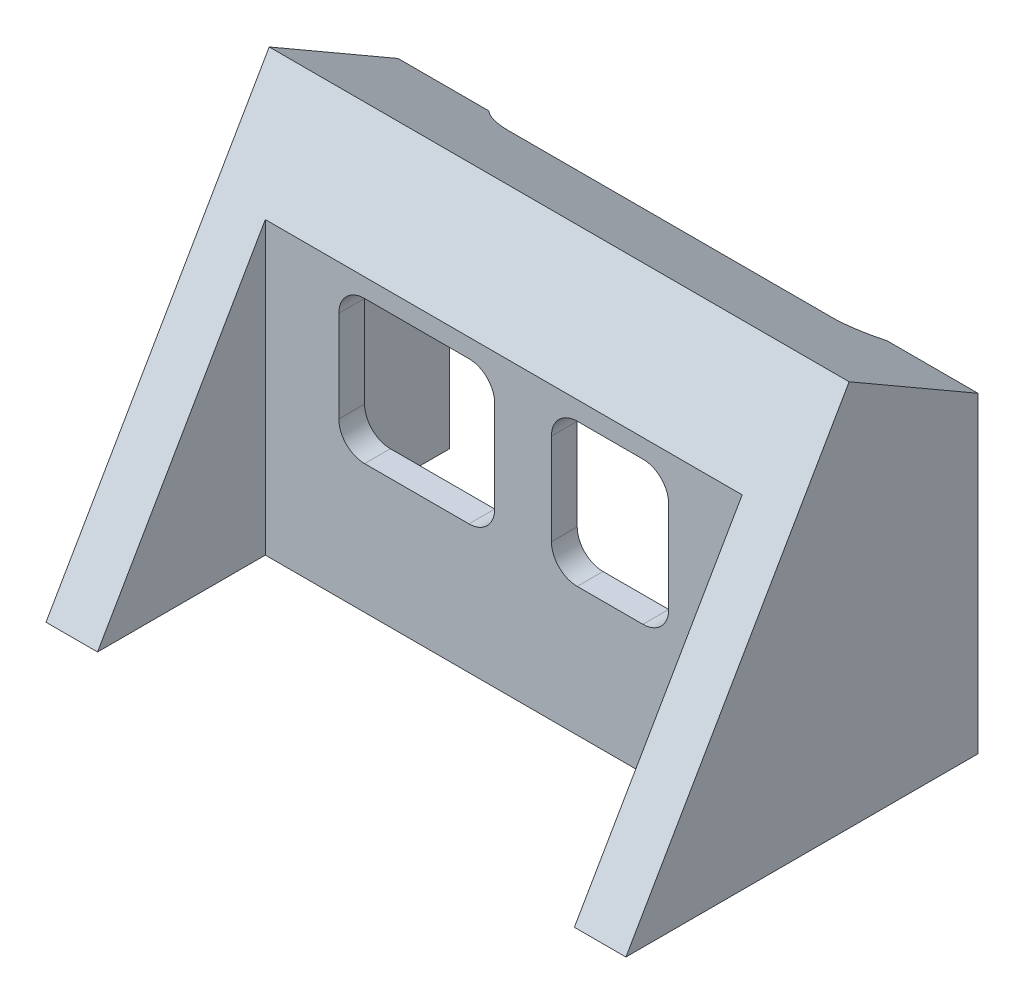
ISO-10303-21;
HEADER;
FILE_DESCRIPTION(('STEP AP214'),'2;1');
FILE_NAME('part.step','',(''),(''),'','','');
FILE_SCHEMA(('AUTOMOTIVE_DESIGN { 1 0 10303 214 1 1 1 1 }'));
ENDSEC;
DATA;
#1=APPLICATION_CONTEXT('core data for automotive mechanical design processes');
#2=APPLICATION_PROTOCOL_DEFINITION('international standard','automotive_design',2000,#1);
#3=PRODUCT_CONTEXT('',#1,'mechanical');
#4=PRODUCT('Part','Part','',(#3));
#5=PRODUCT_RELATED_PRODUCT_CATEGORY('part','',(#4));
#6=PRODUCT_DEFINITION_FORMATION('','',#4);
#7=PRODUCT_DEFINITION_CONTEXT('part definition',#1,'design');
#8=PRODUCT_DEFINITION('design','',#6,#7);
#9=PRODUCT_DEFINITION_SHAPE('','',#8);
#10=(LENGTH_UNIT() NAMED_UNIT(*) SI_UNIT(.MILLI.,.METRE.));
#11=(NAMED_UNIT(*) PLANE_ANGLE_UNIT() SI_UNIT($,.RADIAN.));
#12=(NAMED_UNIT(*) SI_UNIT($,.STERADIAN.) SOLID_ANGLE_UNIT());
#13=UNCERTAINTY_MEASURE_WITH_UNIT(LENGTH_MEASURE(1.E-05),#10,'distance_accuracy_value','');
#14=(GEOMETRIC_REPRESENTATION_CONTEXT(3) GLOBAL_UNCERTAINTY_ASSIGNED_CONTEXT((#13)) GLOBAL_UNIT_ASSIGNED_CONTEXT((#10,
#11,#12)) REPRESENTATION_CONTEXT('',''));
#15=CARTESIAN_POINT('',(0.,0.,0.));
#16=DIRECTION('',(0.,0.,1.));
#17=DIRECTION('',(1.,0.,0.));
#18=AXIS2_PLACEMENT_3D('',#15,#16,#17);
#19=CARTESIAN_POINT('',(22.5,30.,-27.320508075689));
#20=DIRECTION('',(0.,0.,1.));
#21=DIRECTION('',(0.,-1.,0.));
#22=AXIS2_PLACEMENT_3D('',#19,#20,#21);
#23=PLANE('',#22);
#24=DIRECTION('',(0.,1.,0.));
#25=VECTOR('',#24,1.);
#26=CARTESIAN_POINT('',(-22.5,30.,-27.320508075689));
#27=LINE('',#26,#25);
#28=CARTESIAN_POINT('',(-22.5,0.,-27.320508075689));
#29=VERTEX_POINT('',#28);
#30=CARTESIAN_POINT('',(-22.5,24.2264973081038,-27.320508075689));
#31=VERTEX_POINT('',#30);
#32=EDGE_CURVE('E269',#29,#31,#27,.T.);
#33=ORIENTED_EDGE('',*,*,#32,.T.);
#34=DIRECTION('',(1.,0.,0.));
#35=VECTOR('',#34,1.);
#36=CARTESIAN_POINT('',(-22.5,24.2264973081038,-27.320508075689));
#37=LINE('',#36,#35);
#38=CARTESIAN_POINT('',(-15.4468162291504,24.2264973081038,-27.320508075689));
#39=VERTEX_POINT('',#38);
#40=EDGE_CURVE('E58',#31,#39,#37,.T.);
#41=ORIENTED_EDGE('',*,*,#40,.T.);
#42=CARTESIAN_POINT('',(-12.5,19.,-27.320508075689));
#43=DIRECTION('',(0.,0.,1.));
#44=DIRECTION('',(0.,-1.,0.));
#45=AXIS2_PLACEMENT_3D('',#42,#43,#44);
#46=CIRCLE('',#45,6.);
#47=CARTESIAN_POINT('',(-18.5,19.,-27.320508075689));
#48=VERTEX_POINT('',#47);
#49=EDGE_CURVE('E407',#39,#48,#46,.T.);
#50=ORIENTED_EDGE('',*,*,#49,.T.);
#51=DIRECTION('',(0.,-1.,0.));
#52=VECTOR('',#51,1.);
#53=CARTESIAN_POINT('',(-18.5,25.,-27.320508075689));
#54=LINE('',#53,#52);
#55=CARTESIAN_POINT('',(-18.5,0.,-27.320508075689));
#56=VERTEX_POINT('',#55);
#57=EDGE_CURVE('E430',#48,#56,#54,.T.);
#58=ORIENTED_EDGE('',*,*,#57,.T.);
#59=DIRECTION('',(-1.,0.,0.));
#60=VECTOR('',#59,1.);
#61=CARTESIAN_POINT('',(22.5,0.,-27.320508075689));
#62=LINE('',#61,#60);
#63=EDGE_CURVE('E262',#56,#29,#62,.T.);
#64=ORIENTED_EDGE('',*,*,#63,.T.);
#65=EDGE_LOOP('',(#33,#41,#50,#58,#64));
#66=FACE_BOUND('',#65,.T.);
#67=ADVANCED_FACE('F36',(#66),#23,.F.);
#68=CARTESIAN_POINT('',(22.5,0.,-27.320508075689));
#69=DIRECTION('',(0.,1.,0.));
#70=DIRECTION('',(0.,0.,1.));
#71=AXIS2_PLACEMENT_3D('',#68,#69,#70);
#72=PLANE('',#71);
#73=CARTESIAN_POINT('',(-20.5,0.,-7.32050807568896));
#74=DIRECTION('',(0.,-1.,0.));
#75=DIRECTION('',(0.,0.,-1.));
#76=AXIS2_PLACEMENT_3D('',#73,#74,#75);
#77=CIRCLE('',#76,1.24999999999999);
#78=CARTESIAN_POINT('',(-20.5,0.,-8.57050807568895));
#79=VERTEX_POINT('',#78);
#80=EDGE_CURVE('E478',#79,#79,#77,.T.);
#81=ORIENTED_EDGE('',*,*,#80,.F.);
#82=EDGE_LOOP('',(#81));
#83=FACE_BOUND('',#82,.T.);
#84=CARTESIAN_POINT('',(-20.5,0.,-22.320508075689));
#85=DIRECTION('',(0.,-1.,0.));
#86=DIRECTION('',(0.,0.,-1.));
#87=AXIS2_PLACEMENT_3D('',#84,#85,#86);
#88=CIRCLE('',#87,1.24999999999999);
#89=CARTESIAN_POINT('',(-20.5,0.,-23.5705080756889));
#90=VERTEX_POINT('',#89);
#91=EDGE_CURVE('E484',#90,#90,#88,.T.);
#92=ORIENTED_EDGE('',*,*,#91,.F.);
#93=EDGE_LOOP('',(#92));
#94=FACE_BOUND('',#93,.T.);
#95=CARTESIAN_POINT('',(20.5,0.,-7.32050807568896));
#96=DIRECTION('',(0.,-1.,0.));
#97=DIRECTION('',(0.,0.,-1.));
#98=AXIS2_PLACEMENT_3D('',#95,#96,#97);
#99=CIRCLE('',#98,1.24999999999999);
#100=CARTESIAN_POINT('',(20.5,0.,-8.57050807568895));
#101=VERTEX_POINT('',#100);
#102=EDGE_CURVE('E490',#101,#101,#99,.T.);
#103=ORIENTED_EDGE('',*,*,#102,.F.);
#104=EDGE_LOOP('',(#103));
#105=FACE_BOUND('',#104,.T.);
#106=CARTESIAN_POINT('',(20.5,0.,-22.320508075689));
#107=DIRECTION('',(0.,-1.,0.));
#108=DIRECTION('',(0.,0.,-1.));
#109=AXIS2_PLACEMENT_3D('',#106,#107,#108);
#110=CIRCLE('',#109,1.24999999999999);
#111=CARTESIAN_POINT('',(20.5,0.,-23.5705080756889));
#112=VERTEX_POINT('',#111);
#113=EDGE_CURVE('E496',#112,#112,#110,.T.);
#114=ORIENTED_EDGE('',*,*,#113,.F.);
#115=EDGE_LOOP('',(#114));
#116=FACE_BOUND('',#115,.T.);
#117=DIRECTION('',(0.,0.,1.));
#118=VECTOR('',#117,1.);
#119=CARTESIAN_POINT('',(-18.5,0.,-27.320508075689));
#120=LINE('',#119,#118);
#121=CARTESIAN_POINT('',(-18.5,0.,-15.02));
#122=VERTEX_POINT('',#121);
#123=EDGE_CURVE('E436',#56,#122,#120,.T.);
#124=ORIENTED_EDGE('',*,*,#123,.T.);
#125=DIRECTION('',(1.,0.,0.));
#126=VECTOR('',#125,1.);
#127=CARTESIAN_POINT('',(-18.5,0.,-15.02));
#128=LINE('',#127,#126);
#129=CARTESIAN_POINT('',(18.5,0.,-15.02));
#130=VERTEX_POINT('',#129);
#131=EDGE_CURVE('E529',#122,#130,#128,.T.);
#132=ORIENTED_EDGE('',*,*,#131,.T.);
#133=DIRECTION('',(0.,0.,-1.));
#134=VECTOR('',#133,1.);
#135=CARTESIAN_POINT('',(18.5,0.,-15.02));
#136=LINE('',#135,#134);
#137=CARTESIAN_POINT('',(18.5,0.,-27.320508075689));
#138=VERTEX_POINT('',#137);
#139=EDGE_CURVE('E527',#130,#138,#136,.T.);
#140=ORIENTED_EDGE('',*,*,#139,.T.);
#141=CARTESIAN_POINT('',(22.5,0.,-27.320508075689));
#142=VERTEX_POINT('',#141);
#143=EDGE_CURVE('E280',#142,#138,#62,.T.);
#144=ORIENTED_EDGE('',*,*,#143,.F.);
#145=DIRECTION('',(0.,0.,-1.));
#146=VECTOR('',#145,1.);
#147=CARTESIAN_POINT('',(22.5,0.,-27.320508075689));
#148=LINE('',#147,#146);
#149=CARTESIAN_POINT('',(22.5,0.,0.));
#150=VERTEX_POINT('',#149);
#151=EDGE_CURVE('E268',#150,#142,#148,.T.);
#152=ORIENTED_EDGE('',*,*,#151,.F.);
#153=DIRECTION('',(-1.,0.,0.));
#154=VECTOR('',#153,1.);
#155=CARTESIAN_POINT('',(22.5,0.,0.));
#156=LINE('',#155,#154);
#157=CARTESIAN_POINT('',(18.5,0.,0.));
#158=VERTEX_POINT('',#157);
#159=EDGE_CURVE('E263',#150,#158,#156,.T.);
#160=ORIENTED_EDGE('',*,*,#159,.T.);
#161=DIRECTION('',(0.,0.,-1.));
#162=VECTOR('',#161,1.);
#163=CARTESIAN_POINT('',(18.5,0.,-27.320508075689));
#164=LINE('',#163,#162);
#165=CARTESIAN_POINT('',(18.5,0.,-13.02));
#166=VERTEX_POINT('',#165);
#167=EDGE_CURVE('E450',#158,#166,#164,.T.);
#168=ORIENTED_EDGE('',*,*,#167,.T.);
#169=DIRECTION('',(-1.,0.,0.));
#170=VECTOR('',#169,1.);
#171=CARTESIAN_POINT('',(22.5,0.,-13.02));
#172=LINE('',#171,#170);
#173=CARTESIAN_POINT('',(-18.5,0.,-13.02));
#174=VERTEX_POINT('',#173);
#175=EDGE_CURVE('E453',#166,#174,#172,.T.);
#176=ORIENTED_EDGE('',*,*,#175,.T.);
#177=DIRECTION('',(0.,0.,1.));
#178=VECTOR('',#177,1.);
#179=CARTESIAN_POINT('',(-18.5,0.,-27.3205080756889));
#180=LINE('',#179,#178);
#181=CARTESIAN_POINT('',(-18.5,0.,0.));
#182=VERTEX_POINT('',#181);
#183=EDGE_CURVE('E456',#174,#182,#180,.T.);
#184=ORIENTED_EDGE('',*,*,#183,.T.);
#185=CARTESIAN_POINT('',(-22.5,0.,0.));
#186=VERTEX_POINT('',#185);
#187=EDGE_CURVE('E278',#182,#186,#156,.T.);
#188=ORIENTED_EDGE('',*,*,#187,.T.);
#189=DIRECTION('',(0.,0.,-1.));
#190=VECTOR('',#189,1.);
#191=CARTESIAN_POINT('',(-22.5,0.,-27.320508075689));
#192=LINE('',#191,#190);
#193=EDGE_CURVE('E267',#186,#29,#192,.T.);
#194=ORIENTED_EDGE('',*,*,#193,.T.);
#195=ORIENTED_EDGE('',*,*,#63,.F.);
#196=EDGE_LOOP('',(#124,#132,#140,#144,#152,#160,#168,#176,#184,#188,#194,#195));
#197=FACE_BOUND('',#196,.T.);
#198=ADVANCED_FACE('F461',(#83,#94,#105,#116,#197),#72,.F.);
#199=DIRECTION('',(0.,-1.,0.));
#200=VECTOR('',#199,1.);
#201=CARTESIAN_POINT('',(18.5,25.,-27.320508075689));
#202=LINE('',#201,#200);
#203=CARTESIAN_POINT('',(18.5,19.,-27.320508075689));
#204=VERTEX_POINT('',#203);
#205=EDGE_CURVE('E413',#204,#138,#202,.T.);
#206=ORIENTED_EDGE('',*,*,#205,.F.);
#207=CARTESIAN_POINT('',(12.5,19.,-27.320508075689));
#208=DIRECTION('',(0.,0.,1.));
#209=DIRECTION('',(0.,-1.,0.));
#210=AXIS2_PLACEMENT_3D('',#207,#208,#209);
#211=CIRCLE('',#210,6.);
#212=CARTESIAN_POINT('',(15.4468162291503,24.2264973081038,-27.320508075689));
#213=VERTEX_POINT('',#212);
#214=EDGE_CURVE('E44',#204,#213,#211,.T.);
#215=ORIENTED_EDGE('',*,*,#214,.T.);
#216=CARTESIAN_POINT('',(22.5,24.2264973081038,-27.320508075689));
#217=VERTEX_POINT('',#216);
#218=EDGE_CURVE('E50',#213,#217,#37,.T.);
#219=ORIENTED_EDGE('',*,*,#218,.T.);
#220=DIRECTION('',(0.,1.,0.));
#221=VECTOR('',#220,1.);
#222=CARTESIAN_POINT('',(22.5,30.,-27.320508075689));
#223=LINE('',#222,#221);
#224=EDGE_CURVE('E272',#142,#217,#223,.T.);
#225=ORIENTED_EDGE('',*,*,#224,.F.);
#226=ORIENTED_EDGE('',*,*,#143,.T.);
#227=EDGE_LOOP('',(#206,#215,#219,#225,#226));
#228=FACE_BOUND('',#227,.T.);
#229=ADVANCED_FACE('F411',(#228),#23,.F.);
#230=CARTESIAN_POINT('',(22.5,0.,0.));
#231=DIRECTION('',(0.,-0.500000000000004,-0.866025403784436));
#232=DIRECTION('',(0.,0.866025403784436,-0.500000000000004));
#233=AXIS2_PLACEMENT_3D('',#230,#231,#232);
#234=PLANE('',#233);
#235=ORIENTED_EDGE('',*,*,#187,.F.);
#236=DIRECTION('',(0.,0.866025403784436,-0.500000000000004));
#237=VECTOR('',#236,1.);
#238=CARTESIAN_POINT('',(-18.5,0.,0.));
#239=LINE('',#238,#237);
#240=CARTESIAN_POINT('',(-18.5,22.5513015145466,-13.02));
#241=VERTEX_POINT('',#240);
#242=EDGE_CURVE('E289',#182,#241,#239,.T.);
#243=ORIENTED_EDGE('',*,*,#242,.T.);
#244=DIRECTION('',(1.,0.,0.));
#245=VECTOR('',#244,1.);
#246=CARTESIAN_POINT('',(22.5,22.5513015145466,-13.02));
#247=LINE('',#246,#245);
#248=CARTESIAN_POINT('',(18.5,22.5513015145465,-13.02));
#249=VERTEX_POINT('',#248);
#250=EDGE_CURVE('E286',#241,#249,#247,.T.);
#251=ORIENTED_EDGE('',*,*,#250,.T.);
#252=DIRECTION('',(0.,-0.866025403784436,0.500000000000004));
#253=VECTOR('',#252,1.);
#254=CARTESIAN_POINT('',(18.5,0.,0.));
#255=LINE('',#254,#253);
#256=EDGE_CURVE('E283',#249,#158,#255,.T.);
#257=ORIENTED_EDGE('',*,*,#256,.T.);
#258=ORIENTED_EDGE('',*,*,#159,.F.);
#259=DIRECTION('',(0.,-0.866025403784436,0.500000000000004));
#260=VECTOR('',#259,1.);
#261=CARTESIAN_POINT('',(22.5,0.,0.));
#262=LINE('',#261,#260);
#263=CARTESIAN_POINT('',(22.5,30.,-17.3205080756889));
#264=VERTEX_POINT('',#263);
#265=EDGE_CURVE('E261',#264,#150,#262,.T.);
#266=ORIENTED_EDGE('',*,*,#265,.F.);
#267=DIRECTION('',(-1.,0.,0.));
#268=VECTOR('',#267,1.);
#269=CARTESIAN_POINT('',(22.5,30.,-17.3205080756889));
#270=LINE('',#269,#268);
#271=CARTESIAN_POINT('',(-22.5,30.,-17.3205080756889));
#272=VERTEX_POINT('',#271);
#273=EDGE_CURVE('E246',#264,#272,#270,.T.);
#274=ORIENTED_EDGE('',*,*,#273,.T.);
#275=DIRECTION('',(0.,-0.866025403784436,0.500000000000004));
#276=VECTOR('',#275,1.);
#277=CARTESIAN_POINT('',(-22.5,0.,0.));
#278=LINE('',#277,#276);
#279=EDGE_CURVE('E258',#272,#186,#278,.T.);
#280=ORIENTED_EDGE('',*,*,#279,.T.);
#281=EDGE_LOOP('',(#235,#243,#251,#257,#258,#266,#274,#280));
#282=FACE_BOUND('',#281,.T.);
#283=ADVANCED_FACE('F257',(#282),#234,.F.);
#284=CARTESIAN_POINT('',(22.5,0.,0.));
#285=DIRECTION('',(1.,0.,0.));
#286=DIRECTION('',(0.,0.,-1.));
#287=AXIS2_PLACEMENT_3D('',#284,#285,#286);
#288=PLANE('',#287);
#289=DIRECTION('',(0.,-0.499999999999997,-0.866025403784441));
#290=VECTOR('',#289,1.);
#291=CARTESIAN_POINT('',(22.5,30.,-17.3205080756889));
#292=LINE('',#291,#290);
#293=EDGE_CURVE('E251',#264,#217,#292,.T.);
#294=ORIENTED_EDGE('',*,*,#293,.F.);
#295=ORIENTED_EDGE('',*,*,#265,.T.);
#296=ORIENTED_EDGE('',*,*,#151,.T.);
#297=ORIENTED_EDGE('',*,*,#224,.T.);
#298=EDGE_LOOP('',(#294,#295,#296,#297));
#299=FACE_BOUND('',#298,.T.);
#300=ADVANCED_FACE('F474',(#299),#288,.T.);
#301=CARTESIAN_POINT('',(-22.5,0.,0.));
#302=DIRECTION('',(1.,0.,0.));
#303=DIRECTION('',(0.,0.,-1.));
#304=AXIS2_PLACEMENT_3D('',#301,#302,#303);
#305=PLANE('',#304);
#306=ORIENTED_EDGE('',*,*,#279,.F.);
#307=DIRECTION('',(0.,-0.499999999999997,-0.866025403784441));
#308=VECTOR('',#307,1.);
#309=CARTESIAN_POINT('',(-22.5,30.,-17.3205080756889));
#310=LINE('',#309,#308);
#311=EDGE_CURVE('E242',#272,#31,#310,.T.);
#312=ORIENTED_EDGE('',*,*,#311,.T.);
#313=ORIENTED_EDGE('',*,*,#32,.F.);
#314=ORIENTED_EDGE('',*,*,#193,.F.);
#315=EDGE_LOOP('',(#306,#312,#313,#314));
#316=FACE_BOUND('',#315,.T.);
#317=ADVANCED_FACE('F265',(#316),#305,.F.);
#318=CARTESIAN_POINT('',(-18.5,75.7402031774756,0.));
#319=DIRECTION('',(-1.,0.,0.));
#320=DIRECTION('',(0.,0.,1.));
#321=AXIS2_PLACEMENT_3D('',#318,#319,#320);
#322=PLANE('',#321);
#323=ORIENTED_EDGE('',*,*,#183,.F.);
#324=DIRECTION('',(0.,-1.,0.));
#325=VECTOR('',#324,1.);
#326=CARTESIAN_POINT('',(-18.5,75.7402031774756,-13.02));
#327=LINE('',#326,#325);
#328=EDGE_CURVE('E442',#241,#174,#327,.T.);
#329=ORIENTED_EDGE('',*,*,#328,.F.);
#330=ORIENTED_EDGE('',*,*,#242,.F.);
#331=EDGE_LOOP('',(#323,#329,#330));
#332=FACE_BOUND('',#331,.T.);
#333=ADVANCED_FACE('F464',(#332),#322,.F.);
#334=CARTESIAN_POINT('',(-18.5,75.7402031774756,-13.02));
#335=DIRECTION('',(0.,0.,-1.));
#336=DIRECTION('',(-1.,0.,0.));
#337=AXIS2_PLACEMENT_3D('',#334,#335,#336);
#338=PLANE('',#337);
#339=DIRECTION('',(1.,0.,0.));
#340=VECTOR('',#339,1.);
#341=CARTESIAN_POINT('',(3.7,10.,-13.02));
#342=LINE('',#341,#340);
#343=CARTESIAN_POINT('',(5.7,10.,-13.02));
#344=VERTEX_POINT('',#343);
#345=CARTESIAN_POINT('',(10.8,10.,-13.02));
#346=VERTEX_POINT('',#345);
#347=EDGE_CURVE('E505',#344,#346,#342,.T.);
#348=ORIENTED_EDGE('',*,*,#347,.F.);
#349=CARTESIAN_POINT('',(5.7,12.,-13.02));
#350=DIRECTION('',(0.,0.,-1.));
#351=DIRECTION('',(-1.,0.,0.));
#352=AXIS2_PLACEMENT_3D('',#349,#350,#351);
#353=CIRCLE('',#352,2.);
#354=CARTESIAN_POINT('',(3.7,12.,-13.02));
#355=VERTEX_POINT('',#354);
#356=EDGE_CURVE('E367',#344,#355,#353,.T.);
#357=ORIENTED_EDGE('',*,*,#356,.T.);
#358=DIRECTION('',(0.,-1.,0.));
#359=VECTOR('',#358,1.);
#360=CARTESIAN_POINT('',(3.7,10.,-13.02));
#361=LINE('',#360,#359);
#362=CARTESIAN_POINT('',(3.7,19.1,-13.02));
#363=VERTEX_POINT('',#362);
#364=EDGE_CURVE('E502',#363,#355,#361,.T.);
#365=ORIENTED_EDGE('',*,*,#364,.F.);
#366=CARTESIAN_POINT('',(5.7,19.1,-13.02));
#367=DIRECTION('',(0.,0.,-1.));
#368=DIRECTION('',(-1.,0.,0.));
#369=AXIS2_PLACEMENT_3D('',#366,#367,#368);
#370=CIRCLE('',#369,2.);
#371=CARTESIAN_POINT('',(5.7,21.1,-13.02));
#372=VERTEX_POINT('',#371);
#373=EDGE_CURVE('E359',#363,#372,#370,.T.);
#374=ORIENTED_EDGE('',*,*,#373,.T.);
#375=DIRECTION('',(-1.,0.,0.));
#376=VECTOR('',#375,1.);
#377=CARTESIAN_POINT('',(3.7,21.1,-13.02));
#378=LINE('',#377,#376);
#379=CARTESIAN_POINT('',(10.8,21.1,-13.02));
#380=VERTEX_POINT('',#379);
#381=EDGE_CURVE('E511',#380,#372,#378,.T.);
#382=ORIENTED_EDGE('',*,*,#381,.F.);
#383=CARTESIAN_POINT('',(10.8,19.1,-13.02));
#384=DIRECTION('',(0.,0.,-1.));
#385=DIRECTION('',(-1.,0.,0.));
#386=AXIS2_PLACEMENT_3D('',#383,#384,#385);
#387=CIRCLE('',#386,2.);
#388=CARTESIAN_POINT('',(12.8,19.1,-13.02));
#389=VERTEX_POINT('',#388);
#390=EDGE_CURVE('E371',#380,#389,#387,.T.);
#391=ORIENTED_EDGE('',*,*,#390,.T.);
#392=DIRECTION('',(0.,1.,0.));
#393=VECTOR('',#392,1.);
#394=CARTESIAN_POINT('',(12.8,10.,-13.02));
#395=LINE('',#394,#393);
#396=CARTESIAN_POINT('',(12.8,12.,-13.02));
#397=VERTEX_POINT('',#396);
#398=EDGE_CURVE('E508',#397,#389,#395,.T.);
#399=ORIENTED_EDGE('',*,*,#398,.F.);
#400=CARTESIAN_POINT('',(10.8,12.,-13.02));
#401=DIRECTION('',(0.,0.,-1.));
#402=DIRECTION('',(-1.,0.,0.));
#403=AXIS2_PLACEMENT_3D('',#400,#401,#402);
#404=CIRCLE('',#403,2.);
#405=EDGE_CURVE('E363',#397,#346,#404,.T.);
#406=ORIENTED_EDGE('',*,*,#405,.T.);
#407=EDGE_LOOP('',(#348,#357,#365,#374,#382,#391,#399,#406));
#408=FACE_BOUND('',#407,.T.);
#409=DIRECTION('',(1.,0.,0.));
#410=VECTOR('',#409,1.);
#411=CARTESIAN_POINT('',(-12.8,10.,-13.02));
#412=LINE('',#411,#410);
#413=CARTESIAN_POINT('',(-10.8,10.,-13.02));
#414=VERTEX_POINT('',#413);
#415=CARTESIAN_POINT('',(-2.7,10.,-13.02));
#416=VERTEX_POINT('',#415);
#417=EDGE_CURVE('E517',#414,#416,#412,.T.);
#418=ORIENTED_EDGE('',*,*,#417,.F.);
#419=CARTESIAN_POINT('',(-10.8,12.,-13.02));
#420=DIRECTION('',(0.,0.,-1.));
#421=DIRECTION('',(-1.,0.,0.));
#422=AXIS2_PLACEMENT_3D('',#419,#420,#421);
#423=CIRCLE('',#422,2.);
#424=CARTESIAN_POINT('',(-12.8,12.,-13.02));
#425=VERTEX_POINT('',#424);
#426=EDGE_CURVE('E383',#414,#425,#423,.T.);
#427=ORIENTED_EDGE('',*,*,#426,.T.);
#428=DIRECTION('',(0.,-1.,0.));
#429=VECTOR('',#428,1.);
#430=CARTESIAN_POINT('',(-12.8,10.,-13.02));
#431=LINE('',#430,#429);
#432=CARTESIAN_POINT('',(-12.8,19.1,-13.02));
#433=VERTEX_POINT('',#432);
#434=EDGE_CURVE('E514',#433,#425,#431,.T.);
#435=ORIENTED_EDGE('',*,*,#434,.F.);
#436=CARTESIAN_POINT('',(-10.8,19.1,-13.02));
#437=DIRECTION('',(0.,0.,-1.));
#438=DIRECTION('',(-1.,0.,0.));
#439=AXIS2_PLACEMENT_3D('',#436,#437,#438);
#440=CIRCLE('',#439,2.);
#441=CARTESIAN_POINT('',(-10.8,21.1,-13.02));
#442=VERTEX_POINT('',#441);
#443=EDGE_CURVE('E387',#433,#442,#440,.T.);
#444=ORIENTED_EDGE('',*,*,#443,.T.);
#445=DIRECTION('',(-1.,0.,0.));
#446=VECTOR('',#445,1.);
#447=CARTESIAN_POINT('',(-12.8,21.1,-13.02));
#448=LINE('',#447,#446);
#449=CARTESIAN_POINT('',(-2.7,21.1,-13.02));
#450=VERTEX_POINT('',#449);
#451=EDGE_CURVE('E523',#450,#442,#448,.T.);
#452=ORIENTED_EDGE('',*,*,#451,.F.);
#453=CARTESIAN_POINT('',(-2.7,19.1,-13.02));
#454=DIRECTION('',(0.,0.,-1.));
#455=DIRECTION('',(-1.,0.,0.));
#456=AXIS2_PLACEMENT_3D('',#453,#454,#455);
#457=CIRCLE('',#456,2.);
#458=CARTESIAN_POINT('',(-0.699999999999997,19.1,-13.02));
#459=VERTEX_POINT('',#458);
#460=EDGE_CURVE('E375',#450,#459,#457,.T.);
#461=ORIENTED_EDGE('',*,*,#460,.T.);
#462=DIRECTION('',(0.,1.,0.));
#463=VECTOR('',#462,1.);
#464=CARTESIAN_POINT('',(-0.699999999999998,10.,-13.02));
#465=LINE('',#464,#463);
#466=CARTESIAN_POINT('',(-0.699999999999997,12.,-13.02));
#467=VERTEX_POINT('',#466);
#468=EDGE_CURVE('E520',#467,#459,#465,.T.);
#469=ORIENTED_EDGE('',*,*,#468,.F.);
#470=CARTESIAN_POINT('',(-2.7,12.,-13.02));
#471=DIRECTION('',(0.,0.,-1.));
#472=DIRECTION('',(-1.,0.,0.));
#473=AXIS2_PLACEMENT_3D('',#470,#471,#472);
#474=CIRCLE('',#473,2.);
#475=EDGE_CURVE('E379',#467,#416,#474,.T.);
#476=ORIENTED_EDGE('',*,*,#475,.T.);
#477=EDGE_LOOP('',(#418,#427,#435,#444,#452,#461,#469,#476));
#478=FACE_BOUND('',#477,.T.);
#479=ORIENTED_EDGE('',*,*,#175,.F.);
#480=DIRECTION('',(0.,-1.,0.));
#481=VECTOR('',#480,1.);
#482=CARTESIAN_POINT('',(18.5,75.7402031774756,-13.02));
#483=LINE('',#482,#481);
#484=EDGE_CURVE('E438',#249,#166,#483,.T.);
#485=ORIENTED_EDGE('',*,*,#484,.F.);
#486=ORIENTED_EDGE('',*,*,#250,.F.);
#487=ORIENTED_EDGE('',*,*,#328,.T.);
#488=EDGE_LOOP('',(#479,#485,#486,#487));
#489=FACE_BOUND('',#488,.T.);
#490=ADVANCED_FACE('F466',(#408,#478,#489),#338,.F.);
#491=CARTESIAN_POINT('',(18.5,75.7402031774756,-13.02));
#492=DIRECTION('',(1.,0.,0.));
#493=DIRECTION('',(0.,0.,-1.));
#494=AXIS2_PLACEMENT_3D('',#491,#492,#493);
#495=PLANE('',#494);
#496=ORIENTED_EDGE('',*,*,#167,.F.);
#497=ORIENTED_EDGE('',*,*,#256,.F.);
#498=ORIENTED_EDGE('',*,*,#484,.T.);
#499=EDGE_LOOP('',(#496,#497,#498));
#500=FACE_BOUND('',#499,.T.);
#501=ADVANCED_FACE('F470',(#500),#495,.F.);
#502=CARTESIAN_POINT('',(-18.5,25.,-27.320508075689));
#503=DIRECTION('',(1.,0.,0.));
#504=DIRECTION('',(0.,0.,-1.));
#505=AXIS2_PLACEMENT_3D('',#502,#503,#504);
#506=PLANE('',#505);
#507=ORIENTED_EDGE('',*,*,#57,.F.);
#508=DIRECTION('',(0.,0.,1.));
#509=VECTOR('',#508,1.);
#510=CARTESIAN_POINT('',(-18.5,19.,-27.320508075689));
#511=LINE('',#510,#509);
#512=CARTESIAN_POINT('',(-18.5,19.,-15.02));
#513=VERTEX_POINT('',#512);
#514=EDGE_CURVE('E391',#48,#513,#511,.T.);
#515=ORIENTED_EDGE('',*,*,#514,.T.);
#516=DIRECTION('',(0.,-1.,0.));
#517=VECTOR('',#516,1.);
#518=CARTESIAN_POINT('',(-18.5,25.,-15.02));
#519=LINE('',#518,#517);
#520=EDGE_CURVE('E439',#513,#122,#519,.T.);
#521=ORIENTED_EDGE('',*,*,#520,.T.);
#522=ORIENTED_EDGE('',*,*,#123,.F.);
#523=EDGE_LOOP('',(#507,#515,#521,#522));
#524=FACE_BOUND('',#523,.T.);
#525=ADVANCED_FACE('F433',(#524),#506,.T.);
#526=CARTESIAN_POINT('',(-18.5,25.,-15.02));
#527=DIRECTION('',(0.,0.,-1.));
#528=DIRECTION('',(-1.,0.,0.));
#529=AXIS2_PLACEMENT_3D('',#526,#527,#528);
#530=PLANE('',#529);
#531=DIRECTION('',(0.,1.,0.));
#532=VECTOR('',#531,1.);
#533=CARTESIAN_POINT('',(3.7,25.,-15.02));
#534=LINE('',#533,#532);
#535=CARTESIAN_POINT('',(3.7,12.,-15.02));
#536=VERTEX_POINT('',#535);
#537=CARTESIAN_POINT('',(3.7,19.1,-15.02));
#538=VERTEX_POINT('',#537);
#539=EDGE_CURVE('E313',#536,#538,#534,.T.);
#540=ORIENTED_EDGE('',*,*,#539,.F.);
#541=CARTESIAN_POINT('',(5.7,12.,-15.02));
#542=DIRECTION('',(0.,0.,-1.));
#543=DIRECTION('',(-1.,0.,0.));
#544=AXIS2_PLACEMENT_3D('',#541,#542,#543);
#545=CIRCLE('',#544,2.);
#546=CARTESIAN_POINT('',(5.7,10.,-15.02));
#547=VERTEX_POINT('',#546);
#548=EDGE_CURVE('E369',#536,#547,#545,.F.);
#549=ORIENTED_EDGE('',*,*,#548,.T.);
#550=DIRECTION('',(-1.,0.,0.));
#551=VECTOR('',#550,1.);
#552=CARTESIAN_POINT('',(-18.5,10.,-15.02));
#553=LINE('',#552,#551);
#554=CARTESIAN_POINT('',(10.8,10.,-15.02));
#555=VERTEX_POINT('',#554);
#556=EDGE_CURVE('E304',#555,#547,#553,.T.);
#557=ORIENTED_EDGE('',*,*,#556,.F.);
#558=CARTESIAN_POINT('',(10.8,12.,-15.02));
#559=DIRECTION('',(0.,0.,-1.));
#560=DIRECTION('',(-1.,0.,0.));
#561=AXIS2_PLACEMENT_3D('',#558,#559,#560);
#562=CIRCLE('',#561,2.);
#563=CARTESIAN_POINT('',(12.8,12.,-15.02));
#564=VERTEX_POINT('',#563);
#565=EDGE_CURVE('E365',#555,#564,#562,.F.);
#566=ORIENTED_EDGE('',*,*,#565,.T.);
#567=DIRECTION('',(0.,-1.,0.));
#568=VECTOR('',#567,1.);
#569=CARTESIAN_POINT('',(12.8,25.,-15.02));
#570=LINE('',#569,#568);
#571=CARTESIAN_POINT('',(12.8,19.1,-15.02));
#572=VERTEX_POINT('',#571);
#573=EDGE_CURVE('E307',#572,#564,#570,.T.);
#574=ORIENTED_EDGE('',*,*,#573,.F.);
#575=CARTESIAN_POINT('',(10.8,19.1,-15.02));
#576=DIRECTION('',(0.,0.,-1.));
#577=DIRECTION('',(-1.,0.,0.));
#578=AXIS2_PLACEMENT_3D('',#575,#576,#577);
#579=CIRCLE('',#578,2.);
#580=CARTESIAN_POINT('',(10.8,21.1,-15.02));
#581=VERTEX_POINT('',#580);
#582=EDGE_CURVE('E373',#572,#581,#579,.F.);
#583=ORIENTED_EDGE('',*,*,#582,.T.);
#584=DIRECTION('',(1.,0.,0.));
#585=VECTOR('',#584,1.);
#586=CARTESIAN_POINT('',(-18.5,21.1,-15.02));
#587=LINE('',#586,#585);
#588=CARTESIAN_POINT('',(5.7,21.1,-15.02));
#589=VERTEX_POINT('',#588);
#590=EDGE_CURVE('E310',#589,#581,#587,.T.);
#591=ORIENTED_EDGE('',*,*,#590,.F.);
#592=CARTESIAN_POINT('',(5.7,19.1,-15.02));
#593=DIRECTION('',(0.,0.,-1.));
#594=DIRECTION('',(-1.,0.,0.));
#595=AXIS2_PLACEMENT_3D('',#592,#593,#594);
#596=CIRCLE('',#595,2.);
#597=EDGE_CURVE('E361',#589,#538,#596,.F.);
#598=ORIENTED_EDGE('',*,*,#597,.T.);
#599=EDGE_LOOP('',(#540,#549,#557,#566,#574,#583,#591,#598));
#600=FACE_BOUND('',#599,.T.);
#601=DIRECTION('',(0.,1.,0.));
#602=VECTOR('',#601,1.);
#603=CARTESIAN_POINT('',(-12.8,25.,-15.02));
#604=LINE('',#603,#602);
#605=CARTESIAN_POINT('',(-12.8,12.,-15.02));
#606=VERTEX_POINT('',#605);
#607=CARTESIAN_POINT('',(-12.8,19.1,-15.02));
#608=VERTEX_POINT('',#607);
#609=EDGE_CURVE('E301',#606,#608,#604,.T.);
#610=ORIENTED_EDGE('',*,*,#609,.F.);
#611=CARTESIAN_POINT('',(-10.8,12.,-15.02));
#612=DIRECTION('',(0.,0.,-1.));
#613=DIRECTION('',(-1.,0.,0.));
#614=AXIS2_PLACEMENT_3D('',#611,#612,#613);
#615=CIRCLE('',#614,2.);
#616=CARTESIAN_POINT('',(-10.8,10.,-15.02));
#617=VERTEX_POINT('',#616);
#618=EDGE_CURVE('E385',#606,#617,#615,.F.);
#619=ORIENTED_EDGE('',*,*,#618,.T.);
#620=DIRECTION('',(-1.,0.,0.));
#621=VECTOR('',#620,1.);
#622=CARTESIAN_POINT('',(-18.5,10.,-15.02));
#623=LINE('',#622,#621);
#624=CARTESIAN_POINT('',(-2.7,10.,-15.02));
#625=VERTEX_POINT('',#624);
#626=EDGE_CURVE('E292',#625,#617,#623,.T.);
#627=ORIENTED_EDGE('',*,*,#626,.F.);
#628=CARTESIAN_POINT('',(-2.7,12.,-15.02));
#629=DIRECTION('',(0.,0.,-1.));
#630=DIRECTION('',(-1.,0.,0.));
#631=AXIS2_PLACEMENT_3D('',#628,#629,#630);
#632=CIRCLE('',#631,2.);
#633=CARTESIAN_POINT('',(-0.699999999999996,12.,-15.02));
#634=VERTEX_POINT('',#633);
#635=EDGE_CURVE('E381',#625,#634,#632,.F.);
#636=ORIENTED_EDGE('',*,*,#635,.T.);
#637=DIRECTION('',(0.,-1.,0.));
#638=VECTOR('',#637,1.);
#639=CARTESIAN_POINT('',(-0.699999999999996,25.,-15.02));
#640=LINE('',#639,#638);
#641=CARTESIAN_POINT('',(-0.699999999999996,19.1,-15.02));
#642=VERTEX_POINT('',#641);
#643=EDGE_CURVE('E295',#642,#634,#640,.T.);
#644=ORIENTED_EDGE('',*,*,#643,.F.);
#645=CARTESIAN_POINT('',(-2.7,19.1,-15.02));
#646=DIRECTION('',(0.,0.,-1.));
#647=DIRECTION('',(-1.,0.,0.));
#648=AXIS2_PLACEMENT_3D('',#645,#646,#647);
#649=CIRCLE('',#648,2.);
#650=CARTESIAN_POINT('',(-2.7,21.1,-15.02));
#651=VERTEX_POINT('',#650);
#652=EDGE_CURVE('E377',#642,#651,#649,.F.);
#653=ORIENTED_EDGE('',*,*,#652,.T.);
#654=DIRECTION('',(1.,0.,0.));
#655=VECTOR('',#654,1.);
#656=CARTESIAN_POINT('',(-18.5,21.1,-15.02));
#657=LINE('',#656,#655);
#658=CARTESIAN_POINT('',(-10.8,21.1,-15.02));
#659=VERTEX_POINT('',#658);
#660=EDGE_CURVE('E298',#659,#651,#657,.T.);
#661=ORIENTED_EDGE('',*,*,#660,.F.);
#662=CARTESIAN_POINT('',(-10.8,19.1,-15.02));
#663=DIRECTION('',(0.,0.,-1.));
#664=DIRECTION('',(-1.,0.,0.));
#665=AXIS2_PLACEMENT_3D('',#662,#663,#664);
#666=CIRCLE('',#665,2.);
#667=EDGE_CURVE('E389',#659,#608,#666,.F.);
#668=ORIENTED_EDGE('',*,*,#667,.T.);
#669=EDGE_LOOP('',(#610,#619,#627,#636,#644,#653,#661,#668));
#670=FACE_BOUND('',#669,.T.);
#671=ORIENTED_EDGE('',*,*,#520,.F.);
#672=CARTESIAN_POINT('',(-12.5,19.,-15.02));
#673=DIRECTION('',(0.,0.,-1.));
#674=DIRECTION('',(-1.,0.,0.));
#675=AXIS2_PLACEMENT_3D('',#672,#673,#674);
#676=CIRCLE('',#675,6.);
#677=CARTESIAN_POINT('',(-12.5,25.,-15.02));
#678=VERTEX_POINT('',#677);
#679=EDGE_CURVE('E396',#513,#678,#676,.T.);
#680=ORIENTED_EDGE('',*,*,#679,.T.);
#681=DIRECTION('',(1.,0.,0.));
#682=VECTOR('',#681,1.);
#683=CARTESIAN_POINT('',(-18.5,25.,-15.02));
#684=LINE('',#683,#682);
#685=CARTESIAN_POINT('',(12.5,25.,-15.02));
#686=VERTEX_POINT('',#685);
#687=EDGE_CURVE('E424',#678,#686,#684,.T.);
#688=ORIENTED_EDGE('',*,*,#687,.T.);
#689=CARTESIAN_POINT('',(12.5,19.,-15.02));
#690=DIRECTION('',(0.,0.,-1.));
#691=DIRECTION('',(-1.,0.,0.));
#692=AXIS2_PLACEMENT_3D('',#689,#690,#691);
#693=CIRCLE('',#692,6.);
#694=CARTESIAN_POINT('',(18.5,19.,-15.02));
#695=VERTEX_POINT('',#694);
#696=EDGE_CURVE('E394',#686,#695,#693,.T.);
#697=ORIENTED_EDGE('',*,*,#696,.T.);
#698=DIRECTION('',(0.,-1.,0.));
#699=VECTOR('',#698,1.);
#700=CARTESIAN_POINT('',(18.5,25.,-15.02));
#701=LINE('',#700,#699);
#702=EDGE_CURVE('E444',#695,#130,#701,.T.);
#703=ORIENTED_EDGE('',*,*,#702,.T.);
#704=ORIENTED_EDGE('',*,*,#131,.F.);
#705=EDGE_LOOP('',(#671,#680,#688,#697,#703,#704));
#706=FACE_BOUND('',#705,.T.);
#707=ADVANCED_FACE('F537',(#600,#670,#706),#530,.T.);
#708=CARTESIAN_POINT('',(18.5,25.,-15.02));
#709=DIRECTION('',(-1.,0.,0.));
#710=DIRECTION('',(0.,0.,1.));
#711=AXIS2_PLACEMENT_3D('',#708,#709,#710);
#712=PLANE('',#711);
#713=ORIENTED_EDGE('',*,*,#702,.F.);
#714=DIRECTION('',(0.,0.,-1.));
#715=VECTOR('',#714,1.);
#716=CARTESIAN_POINT('',(18.5,19.,-15.02));
#717=LINE('',#716,#715);
#718=EDGE_CURVE('E402',#695,#204,#717,.T.);
#719=ORIENTED_EDGE('',*,*,#718,.T.);
#720=ORIENTED_EDGE('',*,*,#205,.T.);
#721=ORIENTED_EDGE('',*,*,#139,.F.);
#722=EDGE_LOOP('',(#713,#719,#720,#721));
#723=FACE_BOUND('',#722,.T.);
#724=ADVANCED_FACE('F539',(#723),#712,.T.);
#725=CARTESIAN_POINT('',(0.,25.,0.));
#726=DIRECTION('',(0.,1.,0.));
#727=DIRECTION('',(0.,0.,1.));
#728=AXIS2_PLACEMENT_3D('',#725,#726,#727);
#729=PLANE('',#728);
#730=ORIENTED_EDGE('',*,*,#687,.F.);
#731=DIRECTION('',(0.,0.,1.));
#732=VECTOR('',#731,1.);
#733=CARTESIAN_POINT('',(-12.5,25.,0.));
#734=LINE('',#733,#732);
#735=CARTESIAN_POINT('',(-12.5,25.,-25.9807621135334));
#736=VERTEX_POINT('',#735);
#737=EDGE_CURVE('E400',#678,#736,#734,.F.);
#738=ORIENTED_EDGE('',*,*,#737,.T.);
#739=DIRECTION('',(1.,0.,0.));
#740=VECTOR('',#739,1.);
#741=CARTESIAN_POINT('',(0.,25.,-25.9807621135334));
#742=LINE('',#741,#740);
#743=CARTESIAN_POINT('',(12.5,25.,-25.9807621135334));
#744=VERTEX_POINT('',#743);
#745=EDGE_CURVE('E316',#736,#744,#742,.T.);
#746=ORIENTED_EDGE('',*,*,#745,.T.);
#747=DIRECTION('',(0.,0.,-1.));
#748=VECTOR('',#747,1.);
#749=CARTESIAN_POINT('',(12.5,25.,0.));
#750=LINE('',#749,#748);
#751=EDGE_CURVE('E398',#744,#686,#750,.F.);
#752=ORIENTED_EDGE('',*,*,#751,.T.);
#753=EDGE_LOOP('',(#730,#738,#746,#752));
#754=FACE_BOUND('',#753,.T.);
#755=ADVANCED_FACE('F421',(#754),#729,.F.);
#756=CARTESIAN_POINT('',(-12.8,10.,-27.320508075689));
#757=DIRECTION('',(-1.,0.,0.));
#758=DIRECTION('',(0.,-1.,0.));
#759=AXIS2_PLACEMENT_3D('',#756,#757,#758);
#760=PLANE('',#759);
#761=ORIENTED_EDGE('',*,*,#434,.T.);
#762=DIRECTION('',(0.,0.,1.));
#763=VECTOR('',#762,1.);
#764=CARTESIAN_POINT('',(-12.8,12.,-15.02));
#765=LINE('',#764,#763);
#766=EDGE_CURVE('E357',#425,#606,#765,.F.);
#767=ORIENTED_EDGE('',*,*,#766,.T.);
#768=ORIENTED_EDGE('',*,*,#609,.T.);
#769=DIRECTION('',(0.,0.,1.));
#770=VECTOR('',#769,1.);
#771=CARTESIAN_POINT('',(-12.8,19.1,-13.02));
#772=LINE('',#771,#770);
#773=EDGE_CURVE('E354',#608,#433,#772,.T.);
#774=ORIENTED_EDGE('',*,*,#773,.T.);
#775=EDGE_LOOP('',(#761,#767,#768,#774));
#776=FACE_BOUND('',#775,.T.);
#777=ADVANCED_FACE('F546',(#776),#760,.F.);
#778=CARTESIAN_POINT('',(-12.8,21.1,-27.320508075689));
#779=DIRECTION('',(0.,1.,0.));
#780=DIRECTION('',(0.,0.,1.));
#781=AXIS2_PLACEMENT_3D('',#778,#779,#780);
#782=PLANE('',#781);
#783=ORIENTED_EDGE('',*,*,#660,.T.);
#784=DIRECTION('',(0.,0.,1.));
#785=VECTOR('',#784,1.);
#786=CARTESIAN_POINT('',(-2.7,21.1,-13.02));
#787=LINE('',#786,#785);
#788=EDGE_CURVE('E341',#651,#450,#787,.T.);
#789=ORIENTED_EDGE('',*,*,#788,.T.);
#790=ORIENTED_EDGE('',*,*,#451,.T.);
#791=DIRECTION('',(0.,0.,1.));
#792=VECTOR('',#791,1.);
#793=CARTESIAN_POINT('',(-10.8,21.1,-15.02));
#794=LINE('',#793,#792);
#795=EDGE_CURVE('E339',#442,#659,#794,.F.);
#796=ORIENTED_EDGE('',*,*,#795,.T.);
#797=EDGE_LOOP('',(#783,#789,#790,#796));
#798=FACE_BOUND('',#797,.T.);
#799=ADVANCED_FACE('F751',(#798),#782,.F.);
#800=CARTESIAN_POINT('',(-0.699999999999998,10.,-27.320508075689));
#801=DIRECTION('',(1.,0.,0.));
#802=DIRECTION('',(0.,1.,0.));
#803=AXIS2_PLACEMENT_3D('',#800,#801,#802);
#804=PLANE('',#803);
#805=ORIENTED_EDGE('',*,*,#468,.T.);
#806=DIRECTION('',(0.,0.,1.));
#807=VECTOR('',#806,1.);
#808=CARTESIAN_POINT('',(-0.699999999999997,19.1,-15.02));
#809=LINE('',#808,#807);
#810=EDGE_CURVE('E347',#459,#642,#809,.F.);
#811=ORIENTED_EDGE('',*,*,#810,.T.);
#812=ORIENTED_EDGE('',*,*,#643,.T.);
#813=DIRECTION('',(0.,0.,1.));
#814=VECTOR('',#813,1.);
#815=CARTESIAN_POINT('',(-0.699999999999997,12.,-13.02));
#816=LINE('',#815,#814);
#817=EDGE_CURVE('E344',#634,#467,#816,.T.);
#818=ORIENTED_EDGE('',*,*,#817,.T.);
#819=EDGE_LOOP('',(#805,#811,#812,#818));
#820=FACE_BOUND('',#819,.T.);
#821=ADVANCED_FACE('F741',(#820),#804,.F.);
#822=CARTESIAN_POINT('',(-12.8,10.,-27.320508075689));
#823=DIRECTION('',(0.,-1.,0.));
#824=DIRECTION('',(0.,0.,-1.));
#825=AXIS2_PLACEMENT_3D('',#822,#823,#824);
#826=PLANE('',#825);
#827=ORIENTED_EDGE('',*,*,#417,.T.);
#828=DIRECTION('',(0.,0.,1.));
#829=VECTOR('',#828,1.);
#830=CARTESIAN_POINT('',(-2.7,10.,-15.02));
#831=LINE('',#830,#829);
#832=EDGE_CURVE('E352',#416,#625,#831,.F.);
#833=ORIENTED_EDGE('',*,*,#832,.T.);
#834=ORIENTED_EDGE('',*,*,#626,.T.);
#835=DIRECTION('',(0.,0.,1.));
#836=VECTOR('',#835,1.);
#837=CARTESIAN_POINT('',(-10.8,10.,-13.02));
#838=LINE('',#837,#836);
#839=EDGE_CURVE('E349',#617,#414,#838,.T.);
#840=ORIENTED_EDGE('',*,*,#839,.T.);
#841=EDGE_LOOP('',(#827,#833,#834,#840));
#842=FACE_BOUND('',#841,.T.);
#843=ADVANCED_FACE('F731',(#842),#826,.F.);
#844=CARTESIAN_POINT('',(3.7,10.,-27.320508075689));
#845=DIRECTION('',(-1.,0.,0.));
#846=DIRECTION('',(0.,-1.,0.));
#847=AXIS2_PLACEMENT_3D('',#844,#845,#846);
#848=PLANE('',#847);
#849=ORIENTED_EDGE('',*,*,#539,.T.);
#850=DIRECTION('',(0.,0.,1.));
#851=VECTOR('',#850,1.);
#852=CARTESIAN_POINT('',(3.7,19.1,-13.02));
#853=LINE('',#852,#851);
#854=EDGE_CURVE('E321',#538,#363,#853,.T.);
#855=ORIENTED_EDGE('',*,*,#854,.T.);
#856=ORIENTED_EDGE('',*,*,#364,.T.);
#857=DIRECTION('',(0.,0.,1.));
#858=VECTOR('',#857,1.);
#859=CARTESIAN_POINT('',(3.7,12.,-15.02));
#860=LINE('',#859,#858);
#861=EDGE_CURVE('E319',#355,#536,#860,.F.);
#862=ORIENTED_EDGE('',*,*,#861,.T.);
#863=EDGE_LOOP('',(#849,#855,#856,#862));
#864=FACE_BOUND('',#863,.T.);
#865=ADVANCED_FACE('F721',(#864),#848,.F.);
#866=CARTESIAN_POINT('',(3.7,21.1,-27.320508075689));
#867=DIRECTION('',(0.,1.,0.));
#868=DIRECTION('',(0.,0.,1.));
#869=AXIS2_PLACEMENT_3D('',#866,#867,#868);
#870=PLANE('',#869);
#871=ORIENTED_EDGE('',*,*,#381,.T.);
#872=DIRECTION('',(0.,0.,1.));
#873=VECTOR('',#872,1.);
#874=CARTESIAN_POINT('',(5.7,21.1,-15.02));
#875=LINE('',#874,#873);
#876=EDGE_CURVE('E327',#372,#589,#875,.F.);
#877=ORIENTED_EDGE('',*,*,#876,.T.);
#878=ORIENTED_EDGE('',*,*,#590,.T.);
#879=DIRECTION('',(0.,0.,1.));
#880=VECTOR('',#879,1.);
#881=CARTESIAN_POINT('',(10.8,21.1,-13.02));
#882=LINE('',#881,#880);
#883=EDGE_CURVE('E324',#581,#380,#882,.T.);
#884=ORIENTED_EDGE('',*,*,#883,.T.);
#885=EDGE_LOOP('',(#871,#877,#878,#884));
#886=FACE_BOUND('',#885,.T.);
#887=ADVANCED_FACE('F711',(#886),#870,.F.);
#888=CARTESIAN_POINT('',(12.8,10.,-27.320508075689));
#889=DIRECTION('',(1.,0.,0.));
#890=DIRECTION('',(0.,0.,-1.));
#891=AXIS2_PLACEMENT_3D('',#888,#889,#890);
#892=PLANE('',#891);
#893=ORIENTED_EDGE('',*,*,#573,.T.);
#894=DIRECTION('',(0.,0.,1.));
#895=VECTOR('',#894,1.);
#896=CARTESIAN_POINT('',(12.8,12.,-13.02));
#897=LINE('',#896,#895);
#898=EDGE_CURVE('E331',#564,#397,#897,.T.);
#899=ORIENTED_EDGE('',*,*,#898,.T.);
#900=ORIENTED_EDGE('',*,*,#398,.T.);
#901=DIRECTION('',(0.,0.,1.));
#902=VECTOR('',#901,1.);
#903=CARTESIAN_POINT('',(12.8,19.1,-15.02));
#904=LINE('',#903,#902);
#905=EDGE_CURVE('E329',#389,#572,#904,.F.);
#906=ORIENTED_EDGE('',*,*,#905,.T.);
#907=EDGE_LOOP('',(#893,#899,#900,#906));
#908=FACE_BOUND('',#907,.T.);
#909=ADVANCED_FACE('F699',(#908),#892,.F.);
#910=CARTESIAN_POINT('',(3.7,10.,-27.320508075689));
#911=DIRECTION('',(0.,-1.,0.));
#912=DIRECTION('',(0.,0.,-1.));
#913=AXIS2_PLACEMENT_3D('',#910,#911,#912);
#914=PLANE('',#913);
#915=ORIENTED_EDGE('',*,*,#347,.T.);
#916=DIRECTION('',(0.,0.,1.));
#917=VECTOR('',#916,1.);
#918=CARTESIAN_POINT('',(10.8,10.,-15.02));
#919=LINE('',#918,#917);
#920=EDGE_CURVE('E337',#346,#555,#919,.F.);
#921=ORIENTED_EDGE('',*,*,#920,.T.);
#922=ORIENTED_EDGE('',*,*,#556,.T.);
#923=DIRECTION('',(0.,0.,1.));
#924=VECTOR('',#923,1.);
#925=CARTESIAN_POINT('',(5.7,10.,-13.02));
#926=LINE('',#925,#924);
#927=EDGE_CURVE('E334',#547,#344,#926,.T.);
#928=ORIENTED_EDGE('',*,*,#927,.T.);
#929=EDGE_LOOP('',(#915,#921,#922,#928));
#930=FACE_BOUND('',#929,.T.);
#931=ADVANCED_FACE('F693',(#930),#914,.F.);
#932=CARTESIAN_POINT('',(20.5,8.50000000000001,-22.320508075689));
#933=DIRECTION('',(0.,-1.,0.));
#934=DIRECTION('',(0.,0.,-1.));
#935=AXIS2_PLACEMENT_3D('',#932,#933,#934);
#936=CONICAL_SURFACE('',#935,1.24999999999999,1.02974425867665);
#937=CARTESIAN_POINT('',(20.5,9.25107577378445,-22.320508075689));
#938=VERTEX_POINT('',#937);
#939=VERTEX_LOOP('',#938);
#940=FACE_BOUND('',#939,.T.);
#941=CARTESIAN_POINT('',(20.5,8.50000000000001,-22.320508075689));
#942=DIRECTION('',(0.,-1.,0.));
#943=DIRECTION('',(0.,0.,-1.));
#944=AXIS2_PLACEMENT_3D('',#941,#942,#943);
#945=CIRCLE('',#944,1.24999999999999);
#946=CARTESIAN_POINT('',(20.5,8.50000000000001,-23.5705080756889));
#947=VERTEX_POINT('',#946);
#948=EDGE_CURVE('E499',#947,#947,#945,.T.);
#949=ORIENTED_EDGE('',*,*,#948,.T.);
#950=EDGE_LOOP('',(#949));
#951=FACE_BOUND('',#950,.T.);
#952=ADVANCED_FACE('F698',(#940,#951),#936,.F.);
#953=CARTESIAN_POINT('',(20.5,0.,-22.320508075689));
#954=DIRECTION('',(0.,-1.,0.));
#955=DIRECTION('',(0.,0.,-1.));
#956=AXIS2_PLACEMENT_3D('',#953,#954,#955);
#957=CYLINDRICAL_SURFACE('',#956,1.24999999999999);
#958=ORIENTED_EDGE('',*,*,#948,.F.);
#959=EDGE_LOOP('',(#958));
#960=FACE_BOUND('',#959,.T.);
#961=ORIENTED_EDGE('',*,*,#113,.T.);
#962=EDGE_LOOP('',(#961));
#963=FACE_BOUND('',#962,.T.);
#964=ADVANCED_FACE('F857',(#960,#963),#957,.F.);
#965=CARTESIAN_POINT('',(20.5,8.50000000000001,-7.32050807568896));
#966=DIRECTION('',(0.,-1.,0.));
#967=DIRECTION('',(0.,0.,-1.));
#968=AXIS2_PLACEMENT_3D('',#965,#966,#967);
#969=CONICAL_SURFACE('',#968,1.24999999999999,1.02974425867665);
#970=CARTESIAN_POINT('',(20.5,9.25107577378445,-7.32050807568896));
#971=VERTEX_POINT('',#970);
#972=VERTEX_LOOP('',#971);
#973=FACE_BOUND('',#972,.T.);
#974=CARTESIAN_POINT('',(20.5,8.50000000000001,-7.32050807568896));
#975=DIRECTION('',(0.,-1.,0.));
#976=DIRECTION('',(0.,0.,-1.));
#977=AXIS2_PLACEMENT_3D('',#974,#975,#976);
#978=CIRCLE('',#977,1.24999999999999);
#979=CARTESIAN_POINT('',(20.5,8.50000000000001,-8.57050807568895));
#980=VERTEX_POINT('',#979);
#981=EDGE_CURVE('E493',#980,#980,#978,.T.);
#982=ORIENTED_EDGE('',*,*,#981,.T.);
#983=EDGE_LOOP('',(#982));
#984=FACE_BOUND('',#983,.T.);
#985=ADVANCED_FACE('F845',(#973,#984),#969,.F.);
#986=CARTESIAN_POINT('',(20.5,0.,-7.32050807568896));
#987=DIRECTION('',(0.,-1.,0.));
#988=DIRECTION('',(0.,0.,-1.));
#989=AXIS2_PLACEMENT_3D('',#986,#987,#988);
#990=CYLINDRICAL_SURFACE('',#989,1.24999999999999);
#991=ORIENTED_EDGE('',*,*,#981,.F.);
#992=EDGE_LOOP('',(#991));
#993=FACE_BOUND('',#992,.T.);
#994=ORIENTED_EDGE('',*,*,#102,.T.);
#995=EDGE_LOOP('',(#994));
#996=FACE_BOUND('',#995,.T.);
#997=ADVANCED_FACE('F835',(#993,#996),#990,.F.);
#998=CARTESIAN_POINT('',(-20.5,8.50000000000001,-22.320508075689));
#999=DIRECTION('',(0.,-1.,0.));
#1000=DIRECTION('',(0.,0.,-1.));
#1001=AXIS2_PLACEMENT_3D('',#998,#999,#1000);
#1002=CONICAL_SURFACE('',#1001,1.24999999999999,1.02974425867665);
#1003=CARTESIAN_POINT('',(-20.5,9.25107577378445,-22.320508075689));
#1004=VERTEX_POINT('',#1003);
#1005=VERTEX_LOOP('',#1004);
#1006=FACE_BOUND('',#1005,.T.);
#1007=CARTESIAN_POINT('',(-20.5,8.50000000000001,-22.320508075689));
#1008=DIRECTION('',(0.,-1.,0.));
#1009=DIRECTION('',(0.,0.,-1.));
#1010=AXIS2_PLACEMENT_3D('',#1007,#1008,#1009);
#1011=CIRCLE('',#1010,1.24999999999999);
#1012=CARTESIAN_POINT('',(-20.5,8.50000000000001,-23.5705080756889));
#1013=VERTEX_POINT('',#1012);
#1014=EDGE_CURVE('E487',#1013,#1013,#1011,.T.);
#1015=ORIENTED_EDGE('',*,*,#1014,.T.);
#1016=EDGE_LOOP('',(#1015));
#1017=FACE_BOUND('',#1016,.T.);
#1018=ADVANCED_FACE('F823',(#1006,#1017),#1002,.F.);
#1019=CARTESIAN_POINT('',(-20.5,0.,-22.320508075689));
#1020=DIRECTION('',(0.,-1.,0.));
#1021=DIRECTION('',(0.,0.,-1.));
#1022=AXIS2_PLACEMENT_3D('',#1019,#1020,#1021);
#1023=CYLINDRICAL_SURFACE('',#1022,1.24999999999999);
#1024=ORIENTED_EDGE('',*,*,#1014,.F.);
#1025=EDGE_LOOP('',(#1024));
#1026=FACE_BOUND('',#1025,.T.);
#1027=ORIENTED_EDGE('',*,*,#91,.T.);
#1028=EDGE_LOOP('',(#1027));
#1029=FACE_BOUND('',#1028,.T.);
#1030=ADVANCED_FACE('F813',(#1026,#1029),#1023,.F.);
#1031=CARTESIAN_POINT('',(-20.5,8.50000000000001,-7.32050807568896));
#1032=DIRECTION('',(0.,-1.,0.));
#1033=DIRECTION('',(0.,0.,-1.));
#1034=AXIS2_PLACEMENT_3D('',#1031,#1032,#1033);
#1035=CONICAL_SURFACE('',#1034,1.24999999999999,1.02974425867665);
#1036=CARTESIAN_POINT('',(-20.5,9.25107577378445,-7.32050807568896));
#1037=VERTEX_POINT('',#1036);
#1038=VERTEX_LOOP('',#1037);
#1039=FACE_BOUND('',#1038,.T.);
#1040=CARTESIAN_POINT('',(-20.5,8.50000000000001,-7.32050807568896));
#1041=DIRECTION('',(0.,-1.,0.));
#1042=DIRECTION('',(0.,0.,-1.));
#1043=AXIS2_PLACEMENT_3D('',#1040,#1041,#1042);
#1044=CIRCLE('',#1043,1.24999999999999);
#1045=CARTESIAN_POINT('',(-20.5,8.50000000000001,-8.57050807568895));
#1046=VERTEX_POINT('',#1045);
#1047=EDGE_CURVE('E481',#1046,#1046,#1044,.T.);
#1048=ORIENTED_EDGE('',*,*,#1047,.T.);
#1049=EDGE_LOOP('',(#1048));
#1050=FACE_BOUND('',#1049,.T.);
#1051=ADVANCED_FACE('F801',(#1039,#1050),#1035,.F.);
#1052=CARTESIAN_POINT('',(-20.5,0.,-7.32050807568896));
#1053=DIRECTION('',(0.,-1.,0.));
#1054=DIRECTION('',(0.,0.,-1.));
#1055=AXIS2_PLACEMENT_3D('',#1052,#1053,#1054);
#1056=CYLINDRICAL_SURFACE('',#1055,1.24999999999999);
#1057=ORIENTED_EDGE('',*,*,#1047,.F.);
#1058=EDGE_LOOP('',(#1057));
#1059=FACE_BOUND('',#1058,.T.);
#1060=ORIENTED_EDGE('',*,*,#80,.T.);
#1061=EDGE_LOOP('',(#1060));
#1062=FACE_BOUND('',#1061,.T.);
#1063=ADVANCED_FACE('F607',(#1059,#1062),#1056,.F.);
#1064=CARTESIAN_POINT('',(-22.5,30.,-17.3205080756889));
#1065=DIRECTION('',(0.,-0.86602540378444,0.499999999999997));
#1066=DIRECTION('',(0.,-0.499999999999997,-0.866025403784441));
#1067=AXIS2_PLACEMENT_3D('',#1064,#1065,#1066);
#1068=PLANE('',#1067);
#1069=ORIENTED_EDGE('',*,*,#745,.F.);
#1070=CARTESIAN_POINT('',(-12.5,19.,-36.3730669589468));
#1071=DIRECTION('',(0.,-0.86602540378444,0.499999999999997));
#1072=DIRECTION('',(0.,0.499999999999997,0.866025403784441));
#1073=AXIS2_PLACEMENT_3D('',#1070,#1071,#1072);
#1074=ELLIPSE('',#1073,12.0000000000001,6.);
#1075=EDGE_CURVE('E405',#736,#39,#1074,.T.);
#1076=ORIENTED_EDGE('',*,*,#1075,.T.);
#1077=ORIENTED_EDGE('',*,*,#40,.F.);
#1078=ORIENTED_EDGE('',*,*,#311,.F.);
#1079=ORIENTED_EDGE('',*,*,#273,.F.);
#1080=ORIENTED_EDGE('',*,*,#293,.T.);
#1081=ORIENTED_EDGE('',*,*,#218,.F.);
#1082=CARTESIAN_POINT('',(12.5,19.,-36.3730669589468));
#1083=DIRECTION('',(0.,-0.86602540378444,0.499999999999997));
#1084=DIRECTION('',(0.,-0.499999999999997,-0.866025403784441));
#1085=AXIS2_PLACEMENT_3D('',#1082,#1083,#1084);
#1086=ELLIPSE('',#1085,12.0000000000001,6.);
#1087=EDGE_CURVE('E11',#213,#744,#1086,.T.);
#1088=ORIENTED_EDGE('',*,*,#1087,.T.);
#1089=EDGE_LOOP('',(#1069,#1076,#1077,#1078,#1079,#1080,#1081,#1088));
#1090=FACE_BOUND('',#1089,.T.);
#1091=ADVANCED_FACE('F245',(#1090),#1068,.F.);
#1092=CARTESIAN_POINT('',(5.7,19.1,-27.320508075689));
#1093=DIRECTION('',(0.,0.,-1.));
#1094=DIRECTION('',(-1.,0.,0.));
#1095=AXIS2_PLACEMENT_3D('',#1092,#1093,#1094);
#1096=CYLINDRICAL_SURFACE('',#1095,2.);
#1097=ORIENTED_EDGE('',*,*,#597,.F.);
#1098=ORIENTED_EDGE('',*,*,#876,.F.);
#1099=ORIENTED_EDGE('',*,*,#373,.F.);
#1100=ORIENTED_EDGE('',*,*,#854,.F.);
#1101=EDGE_LOOP('',(#1097,#1098,#1099,#1100));
#1102=FACE_BOUND('',#1101,.T.);
#1103=ADVANCED_FACE('F606',(#1102),#1096,.F.);
#1104=CARTESIAN_POINT('',(10.8,12.,-27.320508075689));
#1105=DIRECTION('',(0.,0.,-1.));
#1106=DIRECTION('',(-1.,0.,0.));
#1107=AXIS2_PLACEMENT_3D('',#1104,#1105,#1106);
#1108=CYLINDRICAL_SURFACE('',#1107,2.);
#1109=ORIENTED_EDGE('',*,*,#565,.F.);
#1110=ORIENTED_EDGE('',*,*,#920,.F.);
#1111=ORIENTED_EDGE('',*,*,#405,.F.);
#1112=ORIENTED_EDGE('',*,*,#898,.F.);
#1113=EDGE_LOOP('',(#1109,#1110,#1111,#1112));
#1114=FACE_BOUND('',#1113,.T.);
#1115=ADVANCED_FACE('F674',(#1114),#1108,.F.);
#1116=CARTESIAN_POINT('',(5.7,12.,-27.320508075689));
#1117=DIRECTION('',(0.,0.,-1.));
#1118=DIRECTION('',(-1.,0.,0.));
#1119=AXIS2_PLACEMENT_3D('',#1116,#1117,#1118);
#1120=CYLINDRICAL_SURFACE('',#1119,2.);
#1121=ORIENTED_EDGE('',*,*,#548,.F.);
#1122=ORIENTED_EDGE('',*,*,#861,.F.);
#1123=ORIENTED_EDGE('',*,*,#356,.F.);
#1124=ORIENTED_EDGE('',*,*,#927,.F.);
#1125=EDGE_LOOP('',(#1121,#1122,#1123,#1124));
#1126=FACE_BOUND('',#1125,.T.);
#1127=ADVANCED_FACE('F666',(#1126),#1120,.F.);
#1128=CARTESIAN_POINT('',(10.8,19.1,-27.320508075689));
#1129=DIRECTION('',(0.,0.,-1.));
#1130=DIRECTION('',(-1.,0.,0.));
#1131=AXIS2_PLACEMENT_3D('',#1128,#1129,#1130);
#1132=CYLINDRICAL_SURFACE('',#1131,2.);
#1133=ORIENTED_EDGE('',*,*,#582,.F.);
#1134=ORIENTED_EDGE('',*,*,#905,.F.);
#1135=ORIENTED_EDGE('',*,*,#390,.F.);
#1136=ORIENTED_EDGE('',*,*,#883,.F.);
#1137=EDGE_LOOP('',(#1133,#1134,#1135,#1136));
#1138=FACE_BOUND('',#1137,.T.);
#1139=ADVANCED_FACE('F658',(#1138),#1132,.F.);
#1140=CARTESIAN_POINT('',(-2.7,19.1,-27.320508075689));
#1141=DIRECTION('',(0.,0.,-1.));
#1142=DIRECTION('',(-1.,0.,0.));
#1143=AXIS2_PLACEMENT_3D('',#1140,#1141,#1142);
#1144=CYLINDRICAL_SURFACE('',#1143,2.);
#1145=ORIENTED_EDGE('',*,*,#652,.F.);
#1146=ORIENTED_EDGE('',*,*,#810,.F.);
#1147=ORIENTED_EDGE('',*,*,#460,.F.);
#1148=ORIENTED_EDGE('',*,*,#788,.F.);
#1149=EDGE_LOOP('',(#1145,#1146,#1147,#1148));
#1150=FACE_BOUND('',#1149,.T.);
#1151=ADVANCED_FACE('F650',(#1150),#1144,.F.);
#1152=CARTESIAN_POINT('',(-2.7,12.,-27.320508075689));
#1153=DIRECTION('',(0.,0.,-1.));
#1154=DIRECTION('',(-1.,0.,0.));
#1155=AXIS2_PLACEMENT_3D('',#1152,#1153,#1154);
#1156=CYLINDRICAL_SURFACE('',#1155,2.);
#1157=ORIENTED_EDGE('',*,*,#635,.F.);
#1158=ORIENTED_EDGE('',*,*,#832,.F.);
#1159=ORIENTED_EDGE('',*,*,#475,.F.);
#1160=ORIENTED_EDGE('',*,*,#817,.F.);
#1161=EDGE_LOOP('',(#1157,#1158,#1159,#1160));
#1162=FACE_BOUND('',#1161,.T.);
#1163=ADVANCED_FACE('F642',(#1162),#1156,.F.);
#1164=CARTESIAN_POINT('',(-10.8,12.,-27.320508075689));
#1165=DIRECTION('',(0.,0.,-1.));
#1166=DIRECTION('',(-1.,0.,0.));
#1167=AXIS2_PLACEMENT_3D('',#1164,#1165,#1166);
#1168=CYLINDRICAL_SURFACE('',#1167,2.);
#1169=ORIENTED_EDGE('',*,*,#618,.F.);
#1170=ORIENTED_EDGE('',*,*,#766,.F.);
#1171=ORIENTED_EDGE('',*,*,#426,.F.);
#1172=ORIENTED_EDGE('',*,*,#839,.F.);
#1173=EDGE_LOOP('',(#1169,#1170,#1171,#1172));
#1174=FACE_BOUND('',#1173,.T.);
#1175=ADVANCED_FACE('F635',(#1174),#1168,.F.);
#1176=CARTESIAN_POINT('',(-10.8,19.1,-27.320508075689));
#1177=DIRECTION('',(0.,0.,-1.));
#1178=DIRECTION('',(-1.,0.,0.));
#1179=AXIS2_PLACEMENT_3D('',#1176,#1177,#1178);
#1180=CYLINDRICAL_SURFACE('',#1179,2.);
#1181=ORIENTED_EDGE('',*,*,#667,.F.);
#1182=ORIENTED_EDGE('',*,*,#795,.F.);
#1183=ORIENTED_EDGE('',*,*,#443,.F.);
#1184=ORIENTED_EDGE('',*,*,#773,.F.);
#1185=EDGE_LOOP('',(#1181,#1182,#1183,#1184));
#1186=FACE_BOUND('',#1185,.T.);
#1187=ADVANCED_FACE('F620',(#1186),#1180,.F.);
#1188=CARTESIAN_POINT('',(-12.5,19.,-27.320508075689));
#1189=DIRECTION('',(0.,0.,1.));
#1190=DIRECTION('',(1.,0.,0.));
#1191=AXIS2_PLACEMENT_3D('',#1188,#1189,#1190);
#1192=CYLINDRICAL_SURFACE('',#1191,6.);
#1193=ORIENTED_EDGE('',*,*,#1075,.F.);
#1194=ORIENTED_EDGE('',*,*,#737,.F.);
#1195=ORIENTED_EDGE('',*,*,#679,.F.);
#1196=ORIENTED_EDGE('',*,*,#514,.F.);
#1197=ORIENTED_EDGE('',*,*,#49,.F.);
#1198=EDGE_LOOP('',(#1193,#1194,#1195,#1196,#1197));
#1199=FACE_BOUND('',#1198,.T.);
#1200=ADVANCED_FACE('F426',(#1199),#1192,.F.);
#1201=CARTESIAN_POINT('',(12.5,19.,-15.02));
#1202=DIRECTION('',(0.,0.,-1.));
#1203=DIRECTION('',(-1.,0.,0.));
#1204=AXIS2_PLACEMENT_3D('',#1201,#1202,#1203);
#1205=CYLINDRICAL_SURFACE('',#1204,6.);
#1206=ORIENTED_EDGE('',*,*,#696,.F.);
#1207=ORIENTED_EDGE('',*,*,#751,.F.);
#1208=ORIENTED_EDGE('',*,*,#1087,.F.);
#1209=ORIENTED_EDGE('',*,*,#214,.F.);
#1210=ORIENTED_EDGE('',*,*,#718,.F.);
#1211=EDGE_LOOP('',(#1206,#1207,#1208,#1209,#1210));
#1212=FACE_BOUND('',#1211,.T.);
#1213=ADVANCED_FACE('F38',(#1212),#1205,.F.);
#1214=CLOSED_SHELL('',(#67,#198,#229,#283,#300,#317,#333,#490,#501,#525,#707,#724,#755,#777,
#799,#821,#843,#865,#887,#909,#931,#952,#964,#985,#997,#1018,#1030,#1051,#1063,#1091,#1103,
#1115,#1127,#1139,#1151,#1163,#1175,#1187,#1200,#1213));
#1215=MANIFOLD_SOLID_BREP('B2',#1214);
#1216=ADVANCED_BREP_SHAPE_REPRESENTATION('',(#18,#1215),#14);
#1217=SHAPE_DEFINITION_REPRESENTATION(#9,#1216);
ENDSEC;
END-ISO-10303-21;
